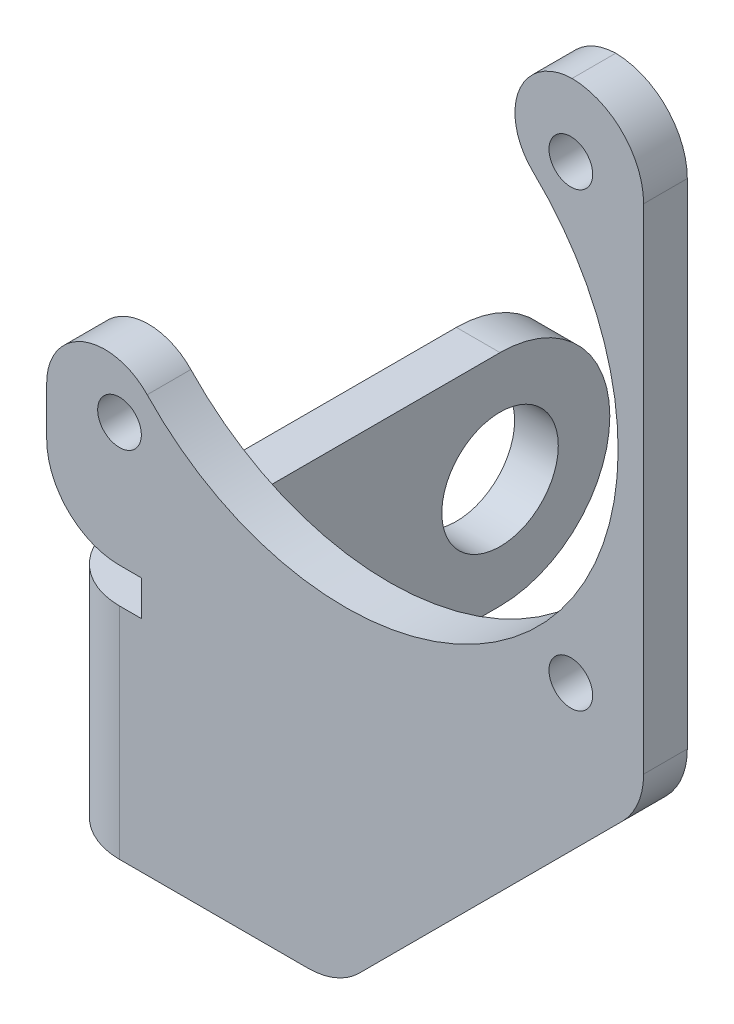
ISO-10303-21;
HEADER;
FILE_DESCRIPTION(('STEP AP214'),'2;1');
FILE_NAME('part.step','',(''),(''),'','','');
FILE_SCHEMA(('AUTOMOTIVE_DESIGN { 1 0 10303 214 1 1 1 1 }'));
ENDSEC;
DATA;
#1=APPLICATION_CONTEXT('core data for automotive mechanical design processes');
#2=APPLICATION_PROTOCOL_DEFINITION('international standard','automotive_design',2000,#1);
#3=PRODUCT_CONTEXT('',#1,'mechanical');
#4=PRODUCT('Part','Part','',(#3));
#5=PRODUCT_RELATED_PRODUCT_CATEGORY('part','',(#4));
#6=PRODUCT_DEFINITION_FORMATION('','',#4);
#7=PRODUCT_DEFINITION_CONTEXT('part definition',#1,'design');
#8=PRODUCT_DEFINITION('design','',#6,#7);
#9=PRODUCT_DEFINITION_SHAPE('','',#8);
#10=(LENGTH_UNIT() NAMED_UNIT(*) SI_UNIT(.MILLI.,.METRE.));
#11=(NAMED_UNIT(*) PLANE_ANGLE_UNIT() SI_UNIT($,.RADIAN.));
#12=(NAMED_UNIT(*) SI_UNIT($,.STERADIAN.) SOLID_ANGLE_UNIT());
#13=UNCERTAINTY_MEASURE_WITH_UNIT(LENGTH_MEASURE(1.E-05),#10,'distance_accuracy_value','');
#14=(GEOMETRIC_REPRESENTATION_CONTEXT(3) GLOBAL_UNCERTAINTY_ASSIGNED_CONTEXT((#13)) GLOBAL_UNIT_ASSIGNED_CONTEXT((#10,
#11,#12)) REPRESENTATION_CONTEXT('',''));
#15=CARTESIAN_POINT('',(0.,0.,0.));
#16=DIRECTION('',(0.,0.,1.));
#17=DIRECTION('',(1.,0.,0.));
#18=AXIS2_PLACEMENT_3D('',#15,#16,#17);
#19=CARTESIAN_POINT('',(-17.5,0.,0.));
#20=DIRECTION('',(-1.,0.,0.));
#21=DIRECTION('',(0.,0.,1.));
#22=AXIS2_PLACEMENT_3D('',#19,#20,#21);
#23=PLANE('',#22);
#24=CARTESIAN_POINT('',(-17.5,-33.9612262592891,-25.1392059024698));
#25=DIRECTION('',(1.,0.,0.));
#26=DIRECTION('',(0.,0.,-1.));
#27=AXIS2_PLACEMENT_3D('',#24,#25,#26);
#28=CIRCLE('',#27,4.);
#29=CARTESIAN_POINT('',(-17.5,-33.9612262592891,-29.1392059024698));
#30=VERTEX_POINT('',#29);
#31=EDGE_CURVE('E146',#30,#30,#28,.F.);
#32=ORIENTED_EDGE('',*,*,#31,.T.);
#33=EDGE_LOOP('',(#32));
#34=FACE_BOUND('',#33,.T.);
#35=CARTESIAN_POINT('',(-17.5000000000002,-33.9612262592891,-25.1392059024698));
#36=DIRECTION('',(1.,0.,0.));
#37=DIRECTION('',(0.,0.,-1.));
#38=AXIS2_PLACEMENT_3D('',#35,#36,#37);
#39=CIRCLE('',#38,7.53877374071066);
#40=CARTESIAN_POINT('',(-17.5,-26.4224525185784,-25.1392059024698));
#41=VERTEX_POINT('',#40);
#42=CARTESIAN_POINT('',(-17.5000000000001,-41.5,-25.1392059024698));
#43=VERTEX_POINT('',#42);
#44=EDGE_CURVE('E20',#41,#43,#39,.F.);
#45=ORIENTED_EDGE('',*,*,#44,.F.);
#46=DIRECTION('',(0.,0.,1.));
#47=VECTOR('',#46,1.);
#48=CARTESIAN_POINT('',(-17.5,-26.4224525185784,0.));
#49=LINE('',#48,#47);
#50=CARTESIAN_POINT('',(-17.5,-26.4224525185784,-2.));
#51=VERTEX_POINT('',#50);
#52=EDGE_CURVE('E141',#41,#51,#49,.T.);
#53=ORIENTED_EDGE('',*,*,#52,.T.);
#54=DIRECTION('',(0.,1.,0.));
#55=VECTOR('',#54,1.);
#56=CARTESIAN_POINT('',(-17.5,-25.5,-2.));
#57=LINE('',#56,#55);
#58=CARTESIAN_POINT('',(-17.5,-41.5,-2.));
#59=VERTEX_POINT('',#58);
#60=EDGE_CURVE('E266',#51,#59,#57,.F.);
#61=ORIENTED_EDGE('',*,*,#60,.T.);
#62=DIRECTION('',(0.,0.,-1.));
#63=VECTOR('',#62,1.);
#64=CARTESIAN_POINT('',(-17.5,-41.5,-37.));
#65=LINE('',#64,#63);
#66=EDGE_CURVE('E144',#43,#59,#65,.F.);
#67=ORIENTED_EDGE('',*,*,#66,.F.);
#68=EDGE_LOOP('',(#45,#53,#61,#67));
#69=FACE_BOUND('',#68,.T.);
#70=ADVANCED_FACE('F17',(#34,#69),#23,.F.);
#71=CARTESIAN_POINT('',(-27.5,-33.9612262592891,-25.1392059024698));
#72=DIRECTION('',(1.,0.,0.));
#73=DIRECTION('',(0.,0.,-1.));
#74=AXIS2_PLACEMENT_3D('',#71,#72,#73);
#75=CYLINDRICAL_SURFACE('',#74,7.53877374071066);
#76=ORIENTED_EDGE('',*,*,#44,.T.);
#77=DIRECTION('',(1.,0.,0.));
#78=VECTOR('',#77,1.);
#79=CARTESIAN_POINT('',(-20.5000000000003,-41.5,-25.1392059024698));
#80=LINE('',#79,#78);
#81=CARTESIAN_POINT('',(-20.5,-41.5,-25.1392059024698));
#82=VERTEX_POINT('',#81);
#83=EDGE_CURVE('E163',#82,#43,#80,.T.);
#84=ORIENTED_EDGE('',*,*,#83,.F.);
#85=CARTESIAN_POINT('',(-20.5,-33.9612262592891,-25.1392059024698));
#86=DIRECTION('',(1.,0.,0.));
#87=DIRECTION('',(0.,0.,-1.));
#88=AXIS2_PLACEMENT_3D('',#85,#86,#87);
#89=CIRCLE('',#88,7.53877374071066);
#90=CARTESIAN_POINT('',(-20.5000000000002,-26.4224525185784,-25.1392059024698));
#91=VERTEX_POINT('',#90);
#92=EDGE_CURVE('E159',#91,#82,#89,.F.);
#93=ORIENTED_EDGE('',*,*,#92,.F.);
#94=DIRECTION('',(1.,0.,0.));
#95=VECTOR('',#94,1.);
#96=CARTESIAN_POINT('',(-27.5,-26.4224525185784,-25.1392059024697));
#97=LINE('',#96,#95);
#98=EDGE_CURVE('E147',#91,#41,#97,.T.);
#99=ORIENTED_EDGE('',*,*,#98,.T.);
#100=EDGE_LOOP('',(#76,#84,#93,#99));
#101=FACE_BOUND('',#100,.T.);
#102=ADVANCED_FACE('F157',(#101),#75,.T.);
#103=CARTESIAN_POINT('',(-27.5,-33.9612262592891,-25.1392059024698));
#104=DIRECTION('',(1.,0.,0.));
#105=DIRECTION('',(0.,0.,-1.));
#106=AXIS2_PLACEMENT_3D('',#103,#104,#105);
#107=CYLINDRICAL_SURFACE('',#106,4.);
#108=CARTESIAN_POINT('',(-20.5000000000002,-33.9612262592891,-25.1392059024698));
#109=DIRECTION('',(1.,0.,0.));
#110=DIRECTION('',(0.,0.,-1.));
#111=AXIS2_PLACEMENT_3D('',#108,#109,#110);
#112=CIRCLE('',#111,4.);
#113=CARTESIAN_POINT('',(-20.5000000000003,-33.9612262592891,-29.1392059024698));
#114=VERTEX_POINT('',#113);
#115=EDGE_CURVE('E255',#114,#114,#112,.T.);
#116=ORIENTED_EDGE('',*,*,#115,.F.);
#117=EDGE_LOOP('',(#116));
#118=FACE_BOUND('',#117,.T.);
#119=ORIENTED_EDGE('',*,*,#31,.F.);
#120=EDGE_LOOP('',(#119));
#121=FACE_BOUND('',#120,.T.);
#122=ADVANCED_FACE('F594',(#118,#121),#107,.F.);
#123=CARTESIAN_POINT('',(-15.5,-25.5,-2.));
#124=DIRECTION('',(0.,1.,0.));
#125=DIRECTION('',(0.,0.,1.));
#126=AXIS2_PLACEMENT_3D('',#123,#124,#125);
#127=CYLINDRICAL_SURFACE('',#126,2.);
#128=DIRECTION('',(0.,1.,0.));
#129=VECTOR('',#128,1.);
#130=CARTESIAN_POINT('',(-15.5,0.,0.));
#131=LINE('',#130,#129);
#132=CARTESIAN_POINT('',(-15.5,-26.4224525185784,0.));
#133=VERTEX_POINT('',#132);
#134=CARTESIAN_POINT('',(-15.5,-41.5,0.));
#135=VERTEX_POINT('',#134);
#136=EDGE_CURVE('E250',#133,#135,#131,.F.);
#137=ORIENTED_EDGE('',*,*,#136,.T.);
#138=CARTESIAN_POINT('',(-15.5,-41.5,-2.));
#139=DIRECTION('',(0.,1.,0.));
#140=DIRECTION('',(0.,0.,1.));
#141=AXIS2_PLACEMENT_3D('',#138,#139,#140);
#142=CIRCLE('',#141,2.);
#143=EDGE_CURVE('E251',#59,#135,#142,.T.);
#144=ORIENTED_EDGE('',*,*,#143,.F.);
#145=ORIENTED_EDGE('',*,*,#60,.F.);
#146=CARTESIAN_POINT('',(-15.5,-26.4224525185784,-2.));
#147=DIRECTION('',(0.,1.,0.));
#148=DIRECTION('',(0.,0.,1.));
#149=AXIS2_PLACEMENT_3D('',#146,#147,#148);
#150=CIRCLE('',#149,2.);
#151=EDGE_CURVE('E155',#133,#51,#150,.F.);
#152=ORIENTED_EDGE('',*,*,#151,.F.);
#153=EDGE_LOOP('',(#137,#144,#145,#152));
#154=FACE_BOUND('',#153,.T.);
#155=ADVANCED_FACE('F385',(#154),#127,.F.);
#156=CARTESIAN_POINT('',(-20.5,-24.,0.));
#157=DIRECTION('',(0.,-1.,0.));
#158=DIRECTION('',(0.,0.,-1.));
#159=AXIS2_PLACEMENT_3D('',#156,#157,#158);
#160=PLANE('',#159);
#161=DIRECTION('',(1.,0.,0.));
#162=VECTOR('',#161,1.);
#163=CARTESIAN_POINT('',(0.,-24.,0.));
#164=LINE('',#163,#162);
#165=CARTESIAN_POINT('',(-15.5,-24.,0.));
#166=VERTEX_POINT('',#165);
#167=CARTESIAN_POINT('',(-14.0000000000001,-24.,0.));
#168=VERTEX_POINT('',#167);
#169=EDGE_CURVE('E254',#166,#168,#164,.T.);
#170=ORIENTED_EDGE('',*,*,#169,.T.);
#171=DIRECTION('',(0.,0.,1.));
#172=VECTOR('',#171,1.);
#173=CARTESIAN_POINT('',(-14.0000000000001,-24.,0.));
#174=LINE('',#173,#172);
#175=CARTESIAN_POINT('',(-14.0000000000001,-24.,3.));
#176=VERTEX_POINT('',#175);
#177=EDGE_CURVE('E272',#176,#168,#174,.F.);
#178=ORIENTED_EDGE('',*,*,#177,.F.);
#179=DIRECTION('',(1.,0.,0.));
#180=VECTOR('',#179,1.);
#181=CARTESIAN_POINT('',(-20.5,-24.,3.));
#182=LINE('',#181,#180);
#183=CARTESIAN_POINT('',(-15.5,-24.,3.));
#184=VERTEX_POINT('',#183);
#185=EDGE_CURVE('E167',#176,#184,#182,.F.);
#186=ORIENTED_EDGE('',*,*,#185,.T.);
#187=DIRECTION('',(0.,0.,-1.));
#188=VECTOR('',#187,1.);
#189=CARTESIAN_POINT('',(-15.5,-24.,3.));
#190=LINE('',#189,#188);
#191=EDGE_CURVE('E234',#166,#184,#190,.F.);
#192=ORIENTED_EDGE('',*,*,#191,.F.);
#193=EDGE_LOOP('',(#170,#178,#186,#192));
#194=FACE_BOUND('',#193,.T.);
#195=ADVANCED_FACE('F369',(#194),#160,.T.);
#196=CARTESIAN_POINT('',(-15.5,-26.4224525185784,-2.));
#197=DIRECTION('',(0.,1.,0.));
#198=DIRECTION('',(0.,0.,1.));
#199=AXIS2_PLACEMENT_3D('',#196,#197,#198);
#200=PLANE('',#199);
#201=CARTESIAN_POINT('',(-15.5,-26.4224525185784,-2.));
#202=DIRECTION('',(0.,1.,0.));
#203=DIRECTION('',(0.,0.,1.));
#204=AXIS2_PLACEMENT_3D('',#201,#202,#203);
#205=CIRCLE('',#204,5.);
#206=CARTESIAN_POINT('',(-15.5,-26.4224525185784,3.));
#207=VERTEX_POINT('',#206);
#208=CARTESIAN_POINT('',(-20.5,-26.4224525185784,-1.99999999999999));
#209=VERTEX_POINT('',#208);
#210=EDGE_CURVE('E227',#207,#209,#205,.F.);
#211=ORIENTED_EDGE('',*,*,#210,.F.);
#212=DIRECTION('',(1.,0.,0.));
#213=VECTOR('',#212,1.);
#214=CARTESIAN_POINT('',(0.,-26.4224525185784,3.));
#215=LINE('',#214,#213);
#216=CARTESIAN_POINT('',(-14.0000000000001,-26.4224525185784,3.));
#217=VERTEX_POINT('',#216);
#218=EDGE_CURVE('E165',#217,#207,#215,.F.);
#219=ORIENTED_EDGE('',*,*,#218,.F.);
#220=DIRECTION('',(0.,0.,1.));
#221=VECTOR('',#220,1.);
#222=CARTESIAN_POINT('',(-14.0000000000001,-26.4224525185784,0.));
#223=LINE('',#222,#221);
#224=CARTESIAN_POINT('',(-14.0000000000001,-26.4224525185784,0.));
#225=VERTEX_POINT('',#224);
#226=EDGE_CURVE('E230',#225,#217,#223,.T.);
#227=ORIENTED_EDGE('',*,*,#226,.F.);
#228=DIRECTION('',(1.,0.,0.));
#229=VECTOR('',#228,1.);
#230=CARTESIAN_POINT('',(0.,-26.4224525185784,0.));
#231=LINE('',#230,#229);
#232=EDGE_CURVE('E287',#225,#133,#231,.F.);
#233=ORIENTED_EDGE('',*,*,#232,.T.);
#234=ORIENTED_EDGE('',*,*,#151,.T.);
#235=ORIENTED_EDGE('',*,*,#52,.F.);
#236=ORIENTED_EDGE('',*,*,#98,.F.);
#237=DIRECTION('',(0.,0.,1.));
#238=VECTOR('',#237,1.);
#239=CARTESIAN_POINT('',(-20.5,-26.4224525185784,0.));
#240=LINE('',#239,#238);
#241=EDGE_CURVE('E260',#209,#91,#240,.F.);
#242=ORIENTED_EDGE('',*,*,#241,.F.);
#243=EDGE_LOOP('',(#211,#219,#227,#233,#234,#235,#236,#242));
#244=FACE_BOUND('',#243,.T.);
#245=ADVANCED_FACE('F152',(#244),#200,.T.);
#246=CARTESIAN_POINT('',(-20.5,0.,0.));
#247=DIRECTION('',(-1.,0.,0.));
#248=DIRECTION('',(0.,0.,1.));
#249=AXIS2_PLACEMENT_3D('',#246,#247,#248);
#250=PLANE('',#249);
#251=ORIENTED_EDGE('',*,*,#115,.T.);
#252=EDGE_LOOP('',(#251));
#253=FACE_BOUND('',#252,.T.);
#254=DIRECTION('',(0.,0.,1.));
#255=VECTOR('',#254,1.);
#256=CARTESIAN_POINT('',(-20.5,-41.5,0.));
#257=LINE('',#256,#255);
#258=CARTESIAN_POINT('',(-20.5,-41.5,-1.99999999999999));
#259=VERTEX_POINT('',#258);
#260=EDGE_CURVE('E258',#82,#259,#257,.T.);
#261=ORIENTED_EDGE('',*,*,#260,.T.);
#262=DIRECTION('',(0.,1.,0.));
#263=VECTOR('',#262,1.);
#264=CARTESIAN_POINT('',(-20.5,-25.5,-1.99999999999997));
#265=LINE('',#264,#263);
#266=EDGE_CURVE('E226',#209,#259,#265,.F.);
#267=ORIENTED_EDGE('',*,*,#266,.F.);
#268=ORIENTED_EDGE('',*,*,#241,.T.);
#269=ORIENTED_EDGE('',*,*,#92,.T.);
#270=EDGE_LOOP('',(#261,#267,#268,#269));
#271=FACE_BOUND('',#270,.T.);
#272=ADVANCED_FACE('F400',(#253,#271),#250,.T.);
#273=CARTESIAN_POINT('',(0.,0.,0.));
#274=DIRECTION('',(0.,0.,1.));
#275=DIRECTION('',(1.,0.,0.));
#276=AXIS2_PLACEMENT_3D('',#273,#274,#275);
#277=PLANE('',#276);
#278=CARTESIAN_POINT('',(15.5,-15.5,0.));
#279=DIRECTION('',(0.,0.,-1.));
#280=DIRECTION('',(-1.,0.,0.));
#281=AXIS2_PLACEMENT_3D('',#278,#279,#280);
#282=CIRCLE('',#281,1.49999999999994);
#283=CARTESIAN_POINT('',(14.0000000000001,-15.5,0.));
#284=VERTEX_POINT('',#283);
#285=EDGE_CURVE('E209',#284,#284,#282,.F.);
#286=ORIENTED_EDGE('',*,*,#285,.T.);
#287=EDGE_LOOP('',(#286));
#288=FACE_BOUND('',#287,.T.);
#289=CARTESIAN_POINT('',(15.5,15.5,0.));
#290=DIRECTION('',(0.,0.,-1.));
#291=DIRECTION('',(-1.,0.,0.));
#292=AXIS2_PLACEMENT_3D('',#289,#290,#291);
#293=CIRCLE('',#292,1.49999999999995);
#294=CARTESIAN_POINT('',(14.0000000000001,15.5,0.));
#295=VERTEX_POINT('',#294);
#296=EDGE_CURVE('E206',#295,#295,#293,.F.);
#297=ORIENTED_EDGE('',*,*,#296,.T.);
#298=EDGE_LOOP('',(#297));
#299=FACE_BOUND('',#298,.T.);
#300=CARTESIAN_POINT('',(-15.5,-15.5,0.));
#301=DIRECTION('',(0.,0.,-1.));
#302=DIRECTION('',(-1.,0.,0.));
#303=AXIS2_PLACEMENT_3D('',#300,#301,#302);
#304=CIRCLE('',#303,1.5);
#305=CARTESIAN_POINT('',(-17.,-15.5,0.));
#306=VERTEX_POINT('',#305);
#307=EDGE_CURVE('E212',#306,#306,#304,.F.);
#308=ORIENTED_EDGE('',*,*,#307,.T.);
#309=EDGE_LOOP('',(#308));
#310=FACE_BOUND('',#309,.T.);
#311=CARTESIAN_POINT('',(15.5,15.5,0.));
#312=DIRECTION('',(0.,0.,-1.));
#313=DIRECTION('',(-1.,0.,0.));
#314=AXIS2_PLACEMENT_3D('',#311,#312,#313);
#315=CIRCLE('',#314,5.);
#316=CARTESIAN_POINT('',(20.5,15.5,0.));
#317=VERTEX_POINT('',#316);
#318=CARTESIAN_POINT('',(15.585754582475,20.4992645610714,0.));
#319=VERTEX_POINT('',#318);
#320=EDGE_CURVE('E247',#317,#319,#315,.F.);
#321=ORIENTED_EDGE('',*,*,#320,.F.);
#322=DIRECTION('',(0.,1.,0.));
#323=VECTOR('',#322,1.);
#324=CARTESIAN_POINT('',(20.5,-20.5,0.));
#325=LINE('',#324,#323);
#326=CARTESIAN_POINT('',(20.5,-18.4289321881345,0.));
#327=VERTEX_POINT('',#326);
#328=EDGE_CURVE('E215',#317,#327,#325,.F.);
#329=ORIENTED_EDGE('',*,*,#328,.T.);
#330=CARTESIAN_POINT('',(15.5,-18.4289321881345,0.));
#331=DIRECTION('',(0.,0.,-1.));
#332=DIRECTION('',(-1.,0.,0.));
#333=AXIS2_PLACEMENT_3D('',#330,#331,#332);
#334=CIRCLE('',#333,5.);
#335=CARTESIAN_POINT('',(19.0355339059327,-21.9644660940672,0.));
#336=VERTEX_POINT('',#335);
#337=EDGE_CURVE('E216',#336,#327,#334,.F.);
#338=ORIENTED_EDGE('',*,*,#337,.F.);
#339=DIRECTION('',(-0.707106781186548,-0.707106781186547,0.));
#340=VECTOR('',#339,1.);
#341=CARTESIAN_POINT('',(-0.500000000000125,-41.5,0.));
#342=LINE('',#341,#340);
#343=CARTESIAN_POINT('',(0.964466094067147,-40.0355339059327,0.));
#344=VERTEX_POINT('',#343);
#345=EDGE_CURVE('E301',#336,#344,#342,.T.);
#346=ORIENTED_EDGE('',*,*,#345,.T.);
#347=CARTESIAN_POINT('',(-2.5710678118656,-36.5,0.));
#348=DIRECTION('',(0.,0.,-1.));
#349=DIRECTION('',(-1.,0.,0.));
#350=AXIS2_PLACEMENT_3D('',#347,#348,#349);
#351=CIRCLE('',#350,5.);
#352=CARTESIAN_POINT('',(-2.5710678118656,-41.5,0.));
#353=VERTEX_POINT('',#352);
#354=EDGE_CURVE('E219',#353,#344,#351,.F.);
#355=ORIENTED_EDGE('',*,*,#354,.F.);
#356=DIRECTION('',(1.,0.,0.));
#357=VECTOR('',#356,1.);
#358=CARTESIAN_POINT('',(-20.5,-41.5,0.));
#359=LINE('',#358,#357);
#360=EDGE_CURVE('E225',#353,#135,#359,.F.);
#361=ORIENTED_EDGE('',*,*,#360,.T.);
#362=ORIENTED_EDGE('',*,*,#136,.F.);
#363=ORIENTED_EDGE('',*,*,#232,.F.);
#364=DIRECTION('',(0.,1.,0.));
#365=VECTOR('',#364,1.);
#366=CARTESIAN_POINT('',(-14.0000000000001,-24.,0.));
#367=LINE('',#366,#365);
#368=EDGE_CURVE('E275',#168,#225,#367,.F.);
#369=ORIENTED_EDGE('',*,*,#368,.F.);
#370=ORIENTED_EDGE('',*,*,#169,.F.);
#371=CARTESIAN_POINT('',(-15.5,-19.,0.));
#372=DIRECTION('',(0.,0.,-1.));
#373=DIRECTION('',(-1.,0.,0.));
#374=AXIS2_PLACEMENT_3D('',#371,#372,#373);
#375=CIRCLE('',#374,5.);
#376=CARTESIAN_POINT('',(-20.5,-19.,0.));
#377=VERTEX_POINT('',#376);
#378=EDGE_CURVE('E231',#377,#166,#375,.F.);
#379=ORIENTED_EDGE('',*,*,#378,.F.);
#380=DIRECTION('',(0.,1.,0.));
#381=VECTOR('',#380,1.);
#382=CARTESIAN_POINT('',(-20.5,20.5,0.));
#383=LINE('',#382,#381);
#384=CARTESIAN_POINT('',(-20.5,-15.662455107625,0.));
#385=VERTEX_POINT('',#384);
#386=EDGE_CURVE('E292',#377,#385,#383,.T.);
#387=ORIENTED_EDGE('',*,*,#386,.T.);
#388=CARTESIAN_POINT('',(-16.5,-15.662455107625,0.));
#389=DIRECTION('',(0.,0.,1.));
#390=DIRECTION('',(1.,0.,0.));
#391=AXIS2_PLACEMENT_3D('',#388,#389,#390);
#392=CIRCLE('',#391,4.);
#393=CARTESIAN_POINT('',(-13.5989010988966,-12.9086168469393,0.));
#394=VERTEX_POINT('',#393);
#395=EDGE_CURVE('E236',#394,#385,#392,.T.);
#396=ORIENTED_EDGE('',*,*,#395,.F.);
#397=CARTESIAN_POINT('',(-1.1901590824E-13,0.,0.));
#398=DIRECTION('',(0.,0.,-1.));
#399=DIRECTION('',(-1.,0.,0.));
#400=AXIS2_PLACEMENT_3D('',#397,#398,#399);
#401=CIRCLE('',#400,18.7499999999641);
#402=CARTESIAN_POINT('',(12.9086168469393,13.5989010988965,0.));
#403=VERTEX_POINT('',#402);
#404=EDGE_CURVE('E241',#394,#403,#401,.F.);
#405=ORIENTED_EDGE('',*,*,#404,.T.);
#406=CARTESIAN_POINT('',(15.6624551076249,16.5,0.));
#407=DIRECTION('',(0.,0.,1.));
#408=DIRECTION('',(1.,0.,0.));
#409=AXIS2_PLACEMENT_3D('',#406,#407,#408);
#410=CIRCLE('',#409,4.);
#411=EDGE_CURVE('E244',#319,#403,#410,.T.);
#412=ORIENTED_EDGE('',*,*,#411,.F.);
#413=EDGE_LOOP('',(#321,#329,#338,#346,#355,#361,#362,#363,#369,#370,#379,#387,#396,#405,#412));
#414=FACE_BOUND('',#413,.T.);
#415=ADVANCED_FACE('F382',(#288,#299,#310,#414),#277,.F.);
#416=CARTESIAN_POINT('',(15.5,15.5,3.));
#417=DIRECTION('',(0.,0.,-1.));
#418=DIRECTION('',(-1.,0.,0.));
#419=AXIS2_PLACEMENT_3D('',#416,#417,#418);
#420=CYLINDRICAL_SURFACE('',#419,5.);
#421=CARTESIAN_POINT('',(15.5,15.5,3.));
#422=DIRECTION('',(0.,0.,-1.));
#423=DIRECTION('',(-1.,0.,0.));
#424=AXIS2_PLACEMENT_3D('',#421,#422,#423);
#425=CIRCLE('',#424,5.);
#426=CARTESIAN_POINT('',(20.5,15.5,3.));
#427=VERTEX_POINT('',#426);
#428=CARTESIAN_POINT('',(15.585754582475,20.4992645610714,3.));
#429=VERTEX_POINT('',#428);
#430=EDGE_CURVE('E203',#427,#429,#425,.F.);
#431=ORIENTED_EDGE('',*,*,#430,.F.);
#432=DIRECTION('',(0.,0.,1.));
#433=VECTOR('',#432,1.);
#434=CARTESIAN_POINT('',(20.5,15.5,3.));
#435=LINE('',#434,#433);
#436=EDGE_CURVE('E306',#427,#317,#435,.F.);
#437=ORIENTED_EDGE('',*,*,#436,.T.);
#438=ORIENTED_EDGE('',*,*,#320,.T.);
#439=DIRECTION('',(0.,0.,1.));
#440=VECTOR('',#439,1.);
#441=CARTESIAN_POINT('',(15.5857545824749,20.4992645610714,-7.));
#442=LINE('',#441,#440);
#443=EDGE_CURVE('E243',#429,#319,#442,.F.);
#444=ORIENTED_EDGE('',*,*,#443,.F.);
#445=EDGE_LOOP('',(#431,#437,#438,#444));
#446=FACE_BOUND('',#445,.T.);
#447=ADVANCED_FACE('F345',(#446),#420,.T.);
#448=CARTESIAN_POINT('',(15.6624551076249,16.5,-7.));
#449=DIRECTION('',(0.,0.,1.));
#450=DIRECTION('',(1.,0.,0.));
#451=AXIS2_PLACEMENT_3D('',#448,#449,#450);
#452=CYLINDRICAL_SURFACE('',#451,4.);
#453=CARTESIAN_POINT('',(15.6624551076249,16.5,3.));
#454=DIRECTION('',(0.,0.,1.));
#455=DIRECTION('',(1.,0.,0.));
#456=AXIS2_PLACEMENT_3D('',#453,#454,#455);
#457=CIRCLE('',#456,4.);
#458=CARTESIAN_POINT('',(12.9086168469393,13.5989010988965,3.));
#459=VERTEX_POINT('',#458);
#460=EDGE_CURVE('E200',#429,#459,#457,.T.);
#461=ORIENTED_EDGE('',*,*,#460,.F.);
#462=ORIENTED_EDGE('',*,*,#443,.T.);
#463=ORIENTED_EDGE('',*,*,#411,.T.);
#464=DIRECTION('',(0.,0.,-1.));
#465=VECTOR('',#464,1.);
#466=CARTESIAN_POINT('',(12.9086168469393,13.5989010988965,3.));
#467=LINE('',#466,#465);
#468=EDGE_CURVE('E240',#403,#459,#467,.F.);
#469=ORIENTED_EDGE('',*,*,#468,.T.);
#470=EDGE_LOOP('',(#461,#462,#463,#469));
#471=FACE_BOUND('',#470,.T.);
#472=ADVANCED_FACE('F348',(#471),#452,.T.);
#473=CARTESIAN_POINT('',(-1.1901590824E-13,0.,3.));
#474=DIRECTION('',(0.,0.,-1.));
#475=DIRECTION('',(-1.,0.,0.));
#476=AXIS2_PLACEMENT_3D('',#473,#474,#475);
#477=CYLINDRICAL_SURFACE('',#476,18.7499999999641);
#478=ORIENTED_EDGE('',*,*,#404,.F.);
#479=DIRECTION('',(0.,0.,1.));
#480=VECTOR('',#479,1.);
#481=CARTESIAN_POINT('',(-13.5989010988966,-12.9086168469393,-7.));
#482=LINE('',#481,#480);
#483=CARTESIAN_POINT('',(-13.5989010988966,-12.9086168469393,3.));
#484=VERTEX_POINT('',#483);
#485=EDGE_CURVE('E239',#484,#394,#482,.F.);
#486=ORIENTED_EDGE('',*,*,#485,.F.);
#487=CARTESIAN_POINT('',(-1.1901590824E-13,0.,3.));
#488=DIRECTION('',(0.,0.,-1.));
#489=DIRECTION('',(-1.,0.,0.));
#490=AXIS2_PLACEMENT_3D('',#487,#488,#489);
#491=CIRCLE('',#490,18.7499999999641);
#492=EDGE_CURVE('E197',#459,#484,#491,.T.);
#493=ORIENTED_EDGE('',*,*,#492,.F.);
#494=ORIENTED_EDGE('',*,*,#468,.F.);
#495=EDGE_LOOP('',(#478,#486,#493,#494));
#496=FACE_BOUND('',#495,.T.);
#497=ADVANCED_FACE('F354',(#496),#477,.F.);
#498=CARTESIAN_POINT('',(-16.5,-15.662455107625,-7.));
#499=DIRECTION('',(0.,0.,1.));
#500=DIRECTION('',(1.,0.,0.));
#501=AXIS2_PLACEMENT_3D('',#498,#499,#500);
#502=CYLINDRICAL_SURFACE('',#501,4.);
#503=CARTESIAN_POINT('',(-16.5,-15.662455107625,3.));
#504=DIRECTION('',(0.,0.,1.));
#505=DIRECTION('',(1.,0.,0.));
#506=AXIS2_PLACEMENT_3D('',#503,#504,#505);
#507=CIRCLE('',#506,4.);
#508=CARTESIAN_POINT('',(-20.5,-15.662455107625,3.));
#509=VERTEX_POINT('',#508);
#510=EDGE_CURVE('E194',#484,#509,#507,.T.);
#511=ORIENTED_EDGE('',*,*,#510,.F.);
#512=ORIENTED_EDGE('',*,*,#485,.T.);
#513=ORIENTED_EDGE('',*,*,#395,.T.);
#514=DIRECTION('',(0.,0.,-1.));
#515=VECTOR('',#514,1.);
#516=CARTESIAN_POINT('',(-20.5,-15.662455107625,3.));
#517=LINE('',#516,#515);
#518=EDGE_CURVE('E235',#385,#509,#517,.F.);
#519=ORIENTED_EDGE('',*,*,#518,.T.);
#520=EDGE_LOOP('',(#511,#512,#513,#519));
#521=FACE_BOUND('',#520,.T.);
#522=ADVANCED_FACE('F356',(#521),#502,.T.);
#523=CARTESIAN_POINT('',(-20.5,20.5,3.));
#524=DIRECTION('',(1.,0.,0.));
#525=DIRECTION('',(0.,0.,-1.));
#526=AXIS2_PLACEMENT_3D('',#523,#524,#525);
#527=PLANE('',#526);
#528=ORIENTED_EDGE('',*,*,#386,.F.);
#529=DIRECTION('',(0.,0.,-1.));
#530=VECTOR('',#529,1.);
#531=CARTESIAN_POINT('',(-20.5,-19.,3.));
#532=LINE('',#531,#530);
#533=CARTESIAN_POINT('',(-20.5,-19.,3.));
#534=VERTEX_POINT('',#533);
#535=EDGE_CURVE('E276',#534,#377,#532,.T.);
#536=ORIENTED_EDGE('',*,*,#535,.F.);
#537=DIRECTION('',(0.,1.,0.));
#538=VECTOR('',#537,1.);
#539=CARTESIAN_POINT('',(-20.5,0.,3.));
#540=LINE('',#539,#538);
#541=EDGE_CURVE('E193',#509,#534,#540,.F.);
#542=ORIENTED_EDGE('',*,*,#541,.F.);
#543=ORIENTED_EDGE('',*,*,#518,.F.);
#544=EDGE_LOOP('',(#528,#536,#542,#543));
#545=FACE_BOUND('',#544,.T.);
#546=ADVANCED_FACE('F361',(#545),#527,.F.);
#547=CARTESIAN_POINT('',(-15.5,-19.,3.));
#548=DIRECTION('',(0.,0.,-1.));
#549=DIRECTION('',(-1.,0.,0.));
#550=AXIS2_PLACEMENT_3D('',#547,#548,#549);
#551=CYLINDRICAL_SURFACE('',#550,5.);
#552=CARTESIAN_POINT('',(-15.5,-19.,3.));
#553=DIRECTION('',(0.,0.,-1.));
#554=DIRECTION('',(-1.,0.,0.));
#555=AXIS2_PLACEMENT_3D('',#552,#553,#554);
#556=CIRCLE('',#555,5.);
#557=EDGE_CURVE('E174',#534,#184,#556,.F.);
#558=ORIENTED_EDGE('',*,*,#557,.F.);
#559=ORIENTED_EDGE('',*,*,#535,.T.);
#560=ORIENTED_EDGE('',*,*,#378,.T.);
#561=ORIENTED_EDGE('',*,*,#191,.T.);
#562=EDGE_LOOP('',(#558,#559,#560,#561));
#563=FACE_BOUND('',#562,.T.);
#564=ADVANCED_FACE('F366',(#563),#551,.T.);
#565=CARTESIAN_POINT('',(-14.0000000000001,-24.,0.));
#566=DIRECTION('',(-1.,0.,0.));
#567=DIRECTION('',(0.,0.,1.));
#568=AXIS2_PLACEMENT_3D('',#565,#566,#567);
#569=PLANE('',#568);
#570=ORIENTED_EDGE('',*,*,#368,.T.);
#571=ORIENTED_EDGE('',*,*,#226,.T.);
#572=DIRECTION('',(0.,1.,0.));
#573=VECTOR('',#572,1.);
#574=CARTESIAN_POINT('',(-14.0000000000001,0.,3.));
#575=LINE('',#574,#573);
#576=EDGE_CURVE('E170',#176,#217,#575,.F.);
#577=ORIENTED_EDGE('',*,*,#576,.F.);
#578=ORIENTED_EDGE('',*,*,#177,.T.);
#579=EDGE_LOOP('',(#570,#571,#577,#578));
#580=FACE_BOUND('',#579,.T.);
#581=ADVANCED_FACE('F373',(#580),#569,.T.);
#582=CARTESIAN_POINT('',(-15.5,-25.5,-2.));
#583=DIRECTION('',(0.,1.,0.));
#584=DIRECTION('',(0.,0.,1.));
#585=AXIS2_PLACEMENT_3D('',#582,#583,#584);
#586=CYLINDRICAL_SURFACE('',#585,5.);
#587=ORIENTED_EDGE('',*,*,#266,.T.);
#588=CARTESIAN_POINT('',(-15.5,-41.5,-2.));
#589=DIRECTION('',(0.,1.,0.));
#590=DIRECTION('',(0.,0.,1.));
#591=AXIS2_PLACEMENT_3D('',#588,#589,#590);
#592=CIRCLE('',#591,5.);
#593=CARTESIAN_POINT('',(-15.5,-41.5,3.));
#594=VERTEX_POINT('',#593);
#595=EDGE_CURVE('E223',#259,#594,#592,.T.);
#596=ORIENTED_EDGE('',*,*,#595,.T.);
#597=DIRECTION('',(0.,1.,0.));
#598=VECTOR('',#597,1.);
#599=CARTESIAN_POINT('',(-15.5,0.,3.));
#600=LINE('',#599,#598);
#601=EDGE_CURVE('E173',#207,#594,#600,.F.);
#602=ORIENTED_EDGE('',*,*,#601,.F.);
#603=ORIENTED_EDGE('',*,*,#210,.T.);
#604=EDGE_LOOP('',(#587,#596,#602,#603));
#605=FACE_BOUND('',#604,.T.);
#606=ADVANCED_FACE('F398',(#605),#586,.T.);
#607=CARTESIAN_POINT('',(-20.5,-41.5,3.));
#608=DIRECTION('',(0.,1.,0.));
#609=DIRECTION('',(0.,0.,1.));
#610=AXIS2_PLACEMENT_3D('',#607,#608,#609);
#611=PLANE('',#610);
#612=DIRECTION('',(0.,0.,-1.));
#613=VECTOR('',#612,1.);
#614=CARTESIAN_POINT('',(-2.5710678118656,-41.5,3.));
#615=LINE('',#614,#613);
#616=CARTESIAN_POINT('',(-2.5710678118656,-41.5,3.));
#617=VERTEX_POINT('',#616);
#618=EDGE_CURVE('E222',#617,#353,#615,.T.);
#619=ORIENTED_EDGE('',*,*,#618,.F.);
#620=DIRECTION('',(1.,0.,0.));
#621=VECTOR('',#620,1.);
#622=CARTESIAN_POINT('',(0.,-41.5,3.));
#623=LINE('',#622,#621);
#624=EDGE_CURVE('E190',#594,#617,#623,.T.);
#625=ORIENTED_EDGE('',*,*,#624,.F.);
#626=ORIENTED_EDGE('',*,*,#595,.F.);
#627=ORIENTED_EDGE('',*,*,#260,.F.);
#628=ORIENTED_EDGE('',*,*,#83,.T.);
#629=ORIENTED_EDGE('',*,*,#66,.T.);
#630=ORIENTED_EDGE('',*,*,#143,.T.);
#631=ORIENTED_EDGE('',*,*,#360,.F.);
#632=EDGE_LOOP('',(#619,#625,#626,#627,#628,#629,#630,#631));
#633=FACE_BOUND('',#632,.T.);
#634=ADVANCED_FACE('F386',(#633),#611,.F.);
#635=CARTESIAN_POINT('',(-2.5710678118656,-36.5,3.));
#636=DIRECTION('',(0.,0.,-1.));
#637=DIRECTION('',(-1.,0.,0.));
#638=AXIS2_PLACEMENT_3D('',#635,#636,#637);
#639=CYLINDRICAL_SURFACE('',#638,5.);
#640=ORIENTED_EDGE('',*,*,#354,.T.);
#641=DIRECTION('',(0.,0.,1.));
#642=VECTOR('',#641,1.);
#643=CARTESIAN_POINT('',(0.964466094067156,-40.0355339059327,3.));
#644=LINE('',#643,#642);
#645=CARTESIAN_POINT('',(0.964466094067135,-40.0355339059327,3.));
#646=VERTEX_POINT('',#645);
#647=EDGE_CURVE('E221',#344,#646,#644,.T.);
#648=ORIENTED_EDGE('',*,*,#647,.T.);
#649=CARTESIAN_POINT('',(-2.5710678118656,-36.5,3.));
#650=DIRECTION('',(0.,0.,-1.));
#651=DIRECTION('',(-1.,0.,0.));
#652=AXIS2_PLACEMENT_3D('',#649,#650,#651);
#653=CIRCLE('',#652,5.);
#654=EDGE_CURVE('E187',#617,#646,#653,.F.);
#655=ORIENTED_EDGE('',*,*,#654,.F.);
#656=ORIENTED_EDGE('',*,*,#618,.T.);
#657=EDGE_LOOP('',(#640,#648,#655,#656));
#658=FACE_BOUND('',#657,.T.);
#659=ADVANCED_FACE('F392',(#658),#639,.T.);
#660=CARTESIAN_POINT('',(-0.500000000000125,-41.5,3.));
#661=DIRECTION('',(-0.707106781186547,0.707106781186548,0.));
#662=DIRECTION('',(-0.707106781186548,-0.707106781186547,0.));
#663=AXIS2_PLACEMENT_3D('',#660,#661,#662);
#664=PLANE('',#663);
#665=DIRECTION('',(0.,0.,-1.));
#666=VECTOR('',#665,1.);
#667=CARTESIAN_POINT('',(19.0355339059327,-21.9644660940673,3.));
#668=LINE('',#667,#666);
#669=CARTESIAN_POINT('',(19.0355339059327,-21.9644660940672,3.));
#670=VERTEX_POINT('',#669);
#671=EDGE_CURVE('E218',#670,#336,#668,.T.);
#672=ORIENTED_EDGE('',*,*,#671,.F.);
#673=DIRECTION('',(0.707106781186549,0.707106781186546,0.));
#674=VECTOR('',#673,1.);
#675=CARTESIAN_POINT('',(0.964466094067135,-40.0355339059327,3.));
#676=LINE('',#675,#674);
#677=EDGE_CURVE('E186',#646,#670,#676,.T.);
#678=ORIENTED_EDGE('',*,*,#677,.F.);
#679=ORIENTED_EDGE('',*,*,#647,.F.);
#680=ORIENTED_EDGE('',*,*,#345,.F.);
#681=EDGE_LOOP('',(#672,#678,#679,#680));
#682=FACE_BOUND('',#681,.T.);
#683=ADVANCED_FACE('F436',(#682),#664,.F.);
#684=CARTESIAN_POINT('',(15.5,-18.4289321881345,3.));
#685=DIRECTION('',(0.,0.,-1.));
#686=DIRECTION('',(-1.,0.,0.));
#687=AXIS2_PLACEMENT_3D('',#684,#685,#686);
#688=CYLINDRICAL_SURFACE('',#687,5.);
#689=ORIENTED_EDGE('',*,*,#337,.T.);
#690=DIRECTION('',(0.,0.,1.));
#691=VECTOR('',#690,1.);
#692=CARTESIAN_POINT('',(20.5,-18.4289321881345,3.));
#693=LINE('',#692,#691);
#694=CARTESIAN_POINT('',(20.5,-18.4289321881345,3.));
#695=VERTEX_POINT('',#694);
#696=EDGE_CURVE('E35',#327,#695,#693,.T.);
#697=ORIENTED_EDGE('',*,*,#696,.T.);
#698=CARTESIAN_POINT('',(15.5,-18.4289321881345,3.));
#699=DIRECTION('',(0.,0.,-1.));
#700=DIRECTION('',(-1.,0.,0.));
#701=AXIS2_PLACEMENT_3D('',#698,#699,#700);
#702=CIRCLE('',#701,5.);
#703=EDGE_CURVE('E183',#670,#695,#702,.F.);
#704=ORIENTED_EDGE('',*,*,#703,.F.);
#705=ORIENTED_EDGE('',*,*,#671,.T.);
#706=EDGE_LOOP('',(#689,#697,#704,#705));
#707=FACE_BOUND('',#706,.T.);
#708=ADVANCED_FACE('F433',(#707),#688,.T.);
#709=CARTESIAN_POINT('',(20.5,-20.5,3.));
#710=DIRECTION('',(-1.,0.,0.));
#711=DIRECTION('',(0.,0.,1.));
#712=AXIS2_PLACEMENT_3D('',#709,#710,#711);
#713=PLANE('',#712);
#714=ORIENTED_EDGE('',*,*,#436,.F.);
#715=DIRECTION('',(0.,1.,0.));
#716=VECTOR('',#715,1.);
#717=CARTESIAN_POINT('',(20.5,0.,3.));
#718=LINE('',#717,#716);
#719=EDGE_CURVE('E182',#695,#427,#718,.T.);
#720=ORIENTED_EDGE('',*,*,#719,.F.);
#721=ORIENTED_EDGE('',*,*,#696,.F.);
#722=ORIENTED_EDGE('',*,*,#328,.F.);
#723=EDGE_LOOP('',(#714,#720,#721,#722));
#724=FACE_BOUND('',#723,.T.);
#725=ADVANCED_FACE('F342',(#724),#713,.F.);
#726=CARTESIAN_POINT('',(-15.5,-15.5,3.));
#727=DIRECTION('',(0.,0.,-1.));
#728=DIRECTION('',(-1.,0.,0.));
#729=AXIS2_PLACEMENT_3D('',#726,#727,#728);
#730=CYLINDRICAL_SURFACE('',#729,1.5);
#731=CARTESIAN_POINT('',(-15.5,-15.5,3.));
#732=DIRECTION('',(0.,0.,-1.));
#733=DIRECTION('',(-1.,0.,0.));
#734=AXIS2_PLACEMENT_3D('',#731,#732,#733);
#735=CIRCLE('',#734,1.5);
#736=CARTESIAN_POINT('',(-17.,-15.5,3.));
#737=VERTEX_POINT('',#736);
#738=EDGE_CURVE('E179',#737,#737,#735,.T.);
#739=ORIENTED_EDGE('',*,*,#738,.F.);
#740=EDGE_LOOP('',(#739));
#741=FACE_BOUND('',#740,.T.);
#742=ORIENTED_EDGE('',*,*,#307,.F.);
#743=EDGE_LOOP('',(#742));
#744=FACE_BOUND('',#743,.T.);
#745=ADVANCED_FACE('F426',(#741,#744),#730,.F.);
#746=CARTESIAN_POINT('',(15.5,-15.5,3.));
#747=DIRECTION('',(0.,0.,-1.));
#748=DIRECTION('',(-1.,0.,0.));
#749=AXIS2_PLACEMENT_3D('',#746,#747,#748);
#750=CYLINDRICAL_SURFACE('',#749,1.49999999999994);
#751=CARTESIAN_POINT('',(15.5,-15.5,3.));
#752=DIRECTION('',(0.,0.,-1.));
#753=DIRECTION('',(-1.,0.,0.));
#754=AXIS2_PLACEMENT_3D('',#751,#752,#753);
#755=CIRCLE('',#754,1.49999999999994);
#756=CARTESIAN_POINT('',(14.0000000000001,-15.5,3.));
#757=VERTEX_POINT('',#756);
#758=EDGE_CURVE('E26',#757,#757,#755,.T.);
#759=ORIENTED_EDGE('',*,*,#758,.F.);
#760=EDGE_LOOP('',(#759));
#761=FACE_BOUND('',#760,.T.);
#762=ORIENTED_EDGE('',*,*,#285,.F.);
#763=EDGE_LOOP('',(#762));
#764=FACE_BOUND('',#763,.T.);
#765=ADVANCED_FACE('F419',(#761,#764),#750,.F.);
#766=CARTESIAN_POINT('',(15.5,15.5,3.));
#767=DIRECTION('',(0.,0.,-1.));
#768=DIRECTION('',(-1.,0.,0.));
#769=AXIS2_PLACEMENT_3D('',#766,#767,#768);
#770=CYLINDRICAL_SURFACE('',#769,1.49999999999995);
#771=CARTESIAN_POINT('',(15.5,15.5,3.));
#772=DIRECTION('',(0.,0.,-1.));
#773=DIRECTION('',(-1.,0.,0.));
#774=AXIS2_PLACEMENT_3D('',#771,#772,#773);
#775=CIRCLE('',#774,1.49999999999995);
#776=CARTESIAN_POINT('',(14.0000000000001,15.5,3.));
#777=VERTEX_POINT('',#776);
#778=EDGE_CURVE('E11',#777,#777,#775,.T.);
#779=ORIENTED_EDGE('',*,*,#778,.F.);
#780=EDGE_LOOP('',(#779));
#781=FACE_BOUND('',#780,.T.);
#782=ORIENTED_EDGE('',*,*,#296,.F.);
#783=EDGE_LOOP('',(#782));
#784=FACE_BOUND('',#783,.T.);
#785=ADVANCED_FACE('F413',(#781,#784),#770,.F.);
#786=CARTESIAN_POINT('',(0.,0.,3.));
#787=DIRECTION('',(0.,0.,1.));
#788=DIRECTION('',(1.,0.,0.));
#789=AXIS2_PLACEMENT_3D('',#786,#787,#788);
#790=PLANE('',#789);
#791=ORIENTED_EDGE('',*,*,#778,.T.);
#792=EDGE_LOOP('',(#791));
#793=FACE_BOUND('',#792,.T.);
#794=ORIENTED_EDGE('',*,*,#758,.T.);
#795=EDGE_LOOP('',(#794));
#796=FACE_BOUND('',#795,.T.);
#797=ORIENTED_EDGE('',*,*,#738,.T.);
#798=EDGE_LOOP('',(#797));
#799=FACE_BOUND('',#798,.T.);
#800=ORIENTED_EDGE('',*,*,#703,.T.);
#801=ORIENTED_EDGE('',*,*,#719,.T.);
#802=ORIENTED_EDGE('',*,*,#430,.T.);
#803=ORIENTED_EDGE('',*,*,#460,.T.);
#804=ORIENTED_EDGE('',*,*,#492,.T.);
#805=ORIENTED_EDGE('',*,*,#510,.T.);
#806=ORIENTED_EDGE('',*,*,#541,.T.);
#807=ORIENTED_EDGE('',*,*,#557,.T.);
#808=ORIENTED_EDGE('',*,*,#185,.F.);
#809=ORIENTED_EDGE('',*,*,#576,.T.);
#810=ORIENTED_EDGE('',*,*,#218,.T.);
#811=ORIENTED_EDGE('',*,*,#601,.T.);
#812=ORIENTED_EDGE('',*,*,#624,.T.);
#813=ORIENTED_EDGE('',*,*,#654,.T.);
#814=ORIENTED_EDGE('',*,*,#677,.T.);
#815=EDGE_LOOP('',(#800,#801,#802,#803,#804,#805,#806,#807,#808,#809,#810,#811,#812,#813,#814));
#816=FACE_BOUND('',#815,.T.);
#817=ADVANCED_FACE('F339',(#793,#796,#799,#816),#790,.T.);
#818=CLOSED_SHELL('',(#70,#102,#122,#155,#195,#245,#272,#415,#447,#472,#497,#522,#546,#564,#581,
#606,#634,#659,#683,#708,#725,#745,#765,#785,#817));
#819=MANIFOLD_SOLID_BREP('B1',#818);
#820=ADVANCED_BREP_SHAPE_REPRESENTATION('',(#18,#819),#14);
#821=SHAPE_DEFINITION_REPRESENTATION(#9,#820);
ENDSEC;
END-ISO-10303-21;
